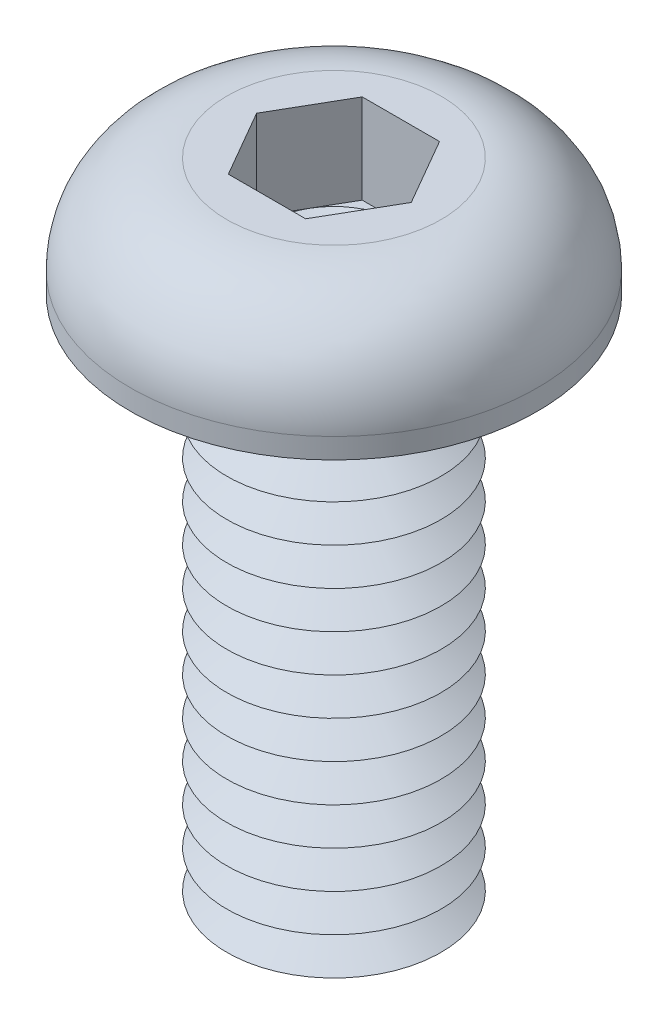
ISO-10303-21;
HEADER;
FILE_DESCRIPTION(('STEP AP214'),'2;1');
FILE_NAME('part.step','',(''),(''),'','','');
FILE_SCHEMA(('AUTOMOTIVE_DESIGN { 1 0 10303 214 1 1 1 1 }'));
ENDSEC;
DATA;
#1=APPLICATION_CONTEXT('core data for automotive mechanical design processes');
#2=APPLICATION_PROTOCOL_DEFINITION('international standard','automotive_design',2000,#1);
#3=PRODUCT_CONTEXT('',#1,'mechanical');
#4=PRODUCT('Part','Part','',(#3));
#5=PRODUCT_RELATED_PRODUCT_CATEGORY('part','',(#4));
#6=PRODUCT_DEFINITION_FORMATION('','',#4);
#7=PRODUCT_DEFINITION_CONTEXT('part definition',#1,'design');
#8=PRODUCT_DEFINITION('design','',#6,#7);
#9=PRODUCT_DEFINITION_SHAPE('','',#8);
#10=(LENGTH_UNIT() NAMED_UNIT(*) SI_UNIT(.MILLI.,.METRE.));
#11=(NAMED_UNIT(*) PLANE_ANGLE_UNIT() SI_UNIT($,.RADIAN.));
#12=(NAMED_UNIT(*) SI_UNIT($,.STERADIAN.) SOLID_ANGLE_UNIT());
#13=UNCERTAINTY_MEASURE_WITH_UNIT(LENGTH_MEASURE(1.E-05),#10,'distance_accuracy_value','');
#14=(GEOMETRIC_REPRESENTATION_CONTEXT(3) GLOBAL_UNCERTAINTY_ASSIGNED_CONTEXT((#13)) GLOBAL_UNIT_ASSIGNED_CONTEXT((#10,
#11,#12)) REPRESENTATION_CONTEXT('',''));
#15=CARTESIAN_POINT('',(0.,0.,0.));
#16=DIRECTION('',(0.,0.,1.));
#17=DIRECTION('',(1.,0.,0.));
#18=AXIS2_PLACEMENT_3D('',#15,#16,#17);
#19=CARTESIAN_POINT('',(0.,0.,0.));
#20=DIRECTION('',(0.,-1.,0.));
#21=DIRECTION('',(0.,0.,-1.));
#22=AXIS2_PLACEMENT_3D('',#19,#20,#21);
#23=TOROIDAL_SURFACE('',#22,2.35,0.35);
#24=CARTESIAN_POINT('',(0.,0.,-2.7));
#25=VERTEX_POINT('',#24);
#26=VERTEX_LOOP('',#25);
#27=FACE_BOUND('',#26,.T.);
#28=ADVANCED_FACE('P0_F12',(#27),#23,.T.);
#29=CLOSED_SHELL('',(#28));
#30=MANIFOLD_SOLID_BREP('P0_B1',#29);
#31=CARTESIAN_POINT('',(0.721687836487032,0.530000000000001,-1.25));
#32=DIRECTION('',(0.,1.,0.));
#33=DIRECTION('',(0.,0.,1.));
#34=AXIS2_PLACEMENT_3D('',#31,#32,#33);
#35=PLANE('',#34);
#36=CARTESIAN_POINT('',(0.,0.530000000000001,0.));
#37=DIRECTION('',(0.,1.,0.));
#38=DIRECTION('',(0.,0.,1.));
#39=AXIS2_PLACEMENT_3D('',#36,#37,#38);
#40=CIRCLE('',#39,1.25);
#41=CARTESIAN_POINT('',(0.,0.530000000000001,1.25));
#42=VERTEX_POINT('',#41);
#43=CARTESIAN_POINT('',(1.08253175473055,0.530000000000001,0.625));
#44=VERTEX_POINT('',#43);
#45=EDGE_CURVE('P1_E93',#42,#44,#40,.T.);
#46=ORIENTED_EDGE('',*,*,#45,.F.);
#47=DIRECTION('',(1.,0.,0.));
#48=VECTOR('',#47,1.);
#49=CARTESIAN_POINT('',(-0.721687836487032,0.530000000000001,1.25));
#50=LINE('',#49,#48);
#51=CARTESIAN_POINT('',(0.721687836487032,0.530000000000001,1.25));
#52=VERTEX_POINT('',#51);
#53=EDGE_CURVE('P1_E116',#42,#52,#50,.T.);
#54=ORIENTED_EDGE('',*,*,#53,.T.);
#55=DIRECTION('',(0.5,0.,-0.866025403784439));
#56=VECTOR('',#55,1.);
#57=CARTESIAN_POINT('',(0.721687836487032,0.530000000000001,1.25));
#58=LINE('',#57,#56);
#59=EDGE_CURVE('P1_E112',#52,#44,#58,.T.);
#60=ORIENTED_EDGE('',*,*,#59,.T.);
#61=EDGE_LOOP('',(#46,#54,#60));
#62=FACE_BOUND('',#61,.T.);
#63=ADVANCED_FACE('P1_F15',(#62),#35,.T.);
#64=CARTESIAN_POINT('',(0.,0.530000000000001,0.));
#65=DIRECTION('',(0.,1.,0.));
#66=DIRECTION('',(0.,0.,1.));
#67=AXIS2_PLACEMENT_3D('',#64,#65,#66);
#68=CIRCLE('',#67,1.25);
#69=CARTESIAN_POINT('',(1.08253175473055,0.530000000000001,-0.625));
#70=VERTEX_POINT('',#69);
#71=EDGE_CURVE('P1_E10',#44,#70,#68,.T.);
#72=ORIENTED_EDGE('',*,*,#71,.F.);
#73=CARTESIAN_POINT('',(1.44337567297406,0.530000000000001,0.));
#74=VERTEX_POINT('',#73);
#75=EDGE_CURVE('P1_E104',#44,#74,#58,.T.);
#76=ORIENTED_EDGE('',*,*,#75,.T.);
#77=DIRECTION('',(-0.5,0.,-0.866025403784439));
#78=VECTOR('',#77,1.);
#79=CARTESIAN_POINT('',(1.44337567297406,0.530000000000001,0.));
#80=LINE('',#79,#78);
#81=EDGE_CURVE('P1_E107',#74,#70,#80,.T.);
#82=ORIENTED_EDGE('',*,*,#81,.T.);
#83=EDGE_LOOP('',(#72,#76,#82));
#84=FACE_BOUND('',#83,.T.);
#85=ADVANCED_FACE('P1_F103',(#84),#35,.T.);
#86=CARTESIAN_POINT('',(0.,0.530000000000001,-1.25));
#87=VERTEX_POINT('',#86);
#88=EDGE_CURVE('P1_E24',#70,#87,#68,.T.);
#89=ORIENTED_EDGE('',*,*,#88,.F.);
#90=CARTESIAN_POINT('',(0.721687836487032,0.530000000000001,-1.25));
#91=VERTEX_POINT('',#90);
#92=EDGE_CURVE('P1_E139',#70,#91,#80,.T.);
#93=ORIENTED_EDGE('',*,*,#92,.T.);
#94=DIRECTION('',(-1.,0.,0.));
#95=VECTOR('',#94,1.);
#96=CARTESIAN_POINT('',(0.721687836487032,0.530000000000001,-1.25));
#97=LINE('',#96,#95);
#98=EDGE_CURVE('P1_E300',#91,#87,#97,.T.);
#99=ORIENTED_EDGE('',*,*,#98,.T.);
#100=EDGE_LOOP('',(#89,#93,#99));
#101=FACE_BOUND('',#100,.T.);
#102=ADVANCED_FACE('P1_F265',(#101),#35,.T.);
#103=CARTESIAN_POINT('',(-1.08253175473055,0.530000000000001,-0.625));
#104=VERTEX_POINT('',#103);
#105=EDGE_CURVE('P1_E295',#87,#104,#68,.T.);
#106=ORIENTED_EDGE('',*,*,#105,.F.);
#107=CARTESIAN_POINT('',(-0.721687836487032,0.530000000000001,-1.25));
#108=VERTEX_POINT('',#107);
#109=EDGE_CURVE('P1_E304',#87,#108,#97,.T.);
#110=ORIENTED_EDGE('',*,*,#109,.T.);
#111=DIRECTION('',(-0.5,0.,0.866025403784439));
#112=VECTOR('',#111,1.);
#113=CARTESIAN_POINT('',(-0.721687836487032,0.530000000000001,-1.25));
#114=LINE('',#113,#112);
#115=EDGE_CURVE('P1_E299',#108,#104,#114,.T.);
#116=ORIENTED_EDGE('',*,*,#115,.T.);
#117=EDGE_LOOP('',(#106,#110,#116));
#118=FACE_BOUND('',#117,.T.);
#119=ADVANCED_FACE('P1_F279',(#118),#35,.T.);
#120=CARTESIAN_POINT('',(-1.08253175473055,0.530000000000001,0.625));
#121=VERTEX_POINT('',#120);
#122=EDGE_CURVE('P1_E31',#104,#121,#68,.T.);
#123=ORIENTED_EDGE('',*,*,#122,.F.);
#124=CARTESIAN_POINT('',(-1.44337567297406,0.530000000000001,0.));
#125=VERTEX_POINT('',#124);
#126=EDGE_CURVE('P1_E291',#104,#125,#114,.T.);
#127=ORIENTED_EDGE('',*,*,#126,.T.);
#128=DIRECTION('',(0.5,0.,0.866025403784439));
#129=VECTOR('',#128,1.);
#130=CARTESIAN_POINT('',(-1.44337567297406,0.530000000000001,0.));
#131=LINE('',#130,#129);
#132=EDGE_CURVE('P1_E294',#125,#121,#131,.T.);
#133=ORIENTED_EDGE('',*,*,#132,.T.);
#134=EDGE_LOOP('',(#123,#127,#133));
#135=FACE_BOUND('',#134,.T.);
#136=ADVANCED_FACE('P1_F270',(#135),#35,.T.);
#137=CARTESIAN_POINT('',(0.,-9.3,0.));
#138=DIRECTION('',(0.,1.,0.));
#139=DIRECTION('',(0.,0.,1.));
#140=AXIS2_PLACEMENT_3D('',#137,#138,#139);
#141=CONICAL_SURFACE('',#140,1.39378221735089,1.0471975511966);
#142=CARTESIAN_POINT('',(0.,-8.95,0.));
#143=DIRECTION('',(0.,-1.,0.));
#144=DIRECTION('',(0.,0.,-1.));
#145=AXIS2_PLACEMENT_3D('',#142,#143,#144);
#146=CIRCLE('',#145,2.);
#147=CARTESIAN_POINT('',(0.,-8.95,-2.));
#148=VERTEX_POINT('',#147);
#149=EDGE_CURVE('P1_E227',#148,#148,#146,.T.);
#150=ORIENTED_EDGE('',*,*,#149,.T.);
#151=EDGE_LOOP('',(#150));
#152=FACE_BOUND('',#151,.T.);
#153=CARTESIAN_POINT('',(0.,-9.3,0.));
#154=DIRECTION('',(0.,-1.,0.));
#155=DIRECTION('',(0.,0.,-1.));
#156=AXIS2_PLACEMENT_3D('',#153,#154,#155);
#157=CIRCLE('',#156,1.39378221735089);
#158=CARTESIAN_POINT('',(0.,-9.3,-1.39378221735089));
#159=VERTEX_POINT('',#158);
#160=EDGE_CURVE('P1_E230',#159,#159,#157,.T.);
#161=ORIENTED_EDGE('',*,*,#160,.F.);
#162=EDGE_LOOP('',(#161));
#163=FACE_BOUND('',#162,.T.);
#164=ADVANCED_FACE('P1_F278',(#152,#163),#141,.T.);
#165=CARTESIAN_POINT('',(0.,-9.65,0.));
#166=DIRECTION('',(0.,-1.,0.));
#167=DIRECTION('',(0.,0.,-1.));
#168=AXIS2_PLACEMENT_3D('',#165,#166,#167);
#169=CONICAL_SURFACE('',#168,2.,1.0471975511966);
#170=ORIENTED_EDGE('',*,*,#160,.T.);
#171=EDGE_LOOP('',(#170));
#172=FACE_BOUND('',#171,.T.);
#173=CARTESIAN_POINT('',(0.,-9.65,0.));
#174=DIRECTION('',(0.,-1.,0.));
#175=DIRECTION('',(0.,0.,-1.));
#176=AXIS2_PLACEMENT_3D('',#173,#174,#175);
#177=CIRCLE('',#176,2.);
#178=CARTESIAN_POINT('',(0.,-9.65,-2.));
#179=VERTEX_POINT('',#178);
#180=EDGE_CURVE('P1_E233',#179,#179,#177,.T.);
#181=ORIENTED_EDGE('',*,*,#180,.F.);
#182=EDGE_LOOP('',(#181));
#183=FACE_BOUND('',#182,.T.);
#184=ADVANCED_FACE('P1_F285',(#172,#183),#169,.T.);
#185=CARTESIAN_POINT('',(0.,-10.,0.));
#186=DIRECTION('',(0.,1.,0.));
#187=DIRECTION('',(0.,0.,1.));
#188=AXIS2_PLACEMENT_3D('',#185,#186,#187);
#189=PLANE('',#188);
#190=CARTESIAN_POINT('',(0.,-10.,0.));
#191=DIRECTION('',(0.,-1.,0.));
#192=DIRECTION('',(0.,0.,-1.));
#193=AXIS2_PLACEMENT_3D('',#190,#191,#192);
#194=CIRCLE('',#193,1.39378221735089);
#195=CARTESIAN_POINT('',(0.,-10.,-1.39378221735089));
#196=VERTEX_POINT('',#195);
#197=EDGE_CURVE('P1_E236',#196,#196,#194,.T.);
#198=ORIENTED_EDGE('',*,*,#197,.T.);
#199=EDGE_LOOP('',(#198));
#200=FACE_BOUND('',#199,.T.);
#201=ADVANCED_FACE('P1_F363',(#200),#189,.F.);
#202=CARTESIAN_POINT('',(0.,-10.,0.));
#203=DIRECTION('',(0.,1.,0.));
#204=DIRECTION('',(0.,0.,1.));
#205=AXIS2_PLACEMENT_3D('',#202,#203,#204);
#206=CONICAL_SURFACE('',#205,1.39378221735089,1.0471975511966);
#207=ORIENTED_EDGE('',*,*,#180,.T.);
#208=EDGE_LOOP('',(#207));
#209=FACE_BOUND('',#208,.T.);
#210=ORIENTED_EDGE('',*,*,#197,.F.);
#211=EDGE_LOOP('',(#210));
#212=FACE_BOUND('',#211,.T.);
#213=ADVANCED_FACE('P1_F374',(#209,#212),#206,.T.);
#214=CARTESIAN_POINT('',(0.,-8.6,0.));
#215=DIRECTION('',(0.,1.,0.));
#216=DIRECTION('',(0.,0.,1.));
#217=AXIS2_PLACEMENT_3D('',#214,#215,#216);
#218=CONICAL_SURFACE('',#217,1.39378221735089,1.0471975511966);
#219=CARTESIAN_POINT('',(0.,-8.25,0.));
#220=DIRECTION('',(0.,-1.,0.));
#221=DIRECTION('',(0.,0.,-1.));
#222=AXIS2_PLACEMENT_3D('',#219,#220,#221);
#223=CIRCLE('',#222,2.);
#224=CARTESIAN_POINT('',(0.,-8.25,-2.));
#225=VERTEX_POINT('',#224);
#226=EDGE_CURVE('P1_E221',#225,#225,#223,.T.);
#227=ORIENTED_EDGE('',*,*,#226,.T.);
#228=EDGE_LOOP('',(#227));
#229=FACE_BOUND('',#228,.T.);
#230=CARTESIAN_POINT('',(0.,-8.6,0.));
#231=DIRECTION('',(0.,-1.,0.));
#232=DIRECTION('',(0.,0.,-1.));
#233=AXIS2_PLACEMENT_3D('',#230,#231,#232);
#234=CIRCLE('',#233,1.39378221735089);
#235=CARTESIAN_POINT('',(0.,-8.6,-1.39378221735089));
#236=VERTEX_POINT('',#235);
#237=EDGE_CURVE('P1_E224',#236,#236,#234,.T.);
#238=ORIENTED_EDGE('',*,*,#237,.F.);
#239=EDGE_LOOP('',(#238));
#240=FACE_BOUND('',#239,.T.);
#241=ADVANCED_FACE('P1_F383',(#229,#240),#218,.T.);
#242=CARTESIAN_POINT('',(0.,-8.95,0.));
#243=DIRECTION('',(0.,-1.,0.));
#244=DIRECTION('',(0.,0.,-1.));
#245=AXIS2_PLACEMENT_3D('',#242,#243,#244);
#246=CONICAL_SURFACE('',#245,2.,1.0471975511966);
#247=ORIENTED_EDGE('',*,*,#237,.T.);
#248=EDGE_LOOP('',(#247));
#249=FACE_BOUND('',#248,.T.);
#250=ORIENTED_EDGE('',*,*,#149,.F.);
#251=EDGE_LOOP('',(#250));
#252=FACE_BOUND('',#251,.T.);
#253=ADVANCED_FACE('P1_F392',(#249,#252),#246,.T.);
#254=CARTESIAN_POINT('',(0.,-7.9,0.));
#255=DIRECTION('',(0.,1.,0.));
#256=DIRECTION('',(0.,0.,1.));
#257=AXIS2_PLACEMENT_3D('',#254,#255,#256);
#258=CONICAL_SURFACE('',#257,1.39378221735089,1.0471975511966);
#259=CARTESIAN_POINT('',(0.,-7.55,0.));
#260=DIRECTION('',(0.,-1.,0.));
#261=DIRECTION('',(0.,0.,-1.));
#262=AXIS2_PLACEMENT_3D('',#259,#260,#261);
#263=CIRCLE('',#262,2.);
#264=CARTESIAN_POINT('',(0.,-7.55,-2.));
#265=VERTEX_POINT('',#264);
#266=EDGE_CURVE('P1_E215',#265,#265,#263,.T.);
#267=ORIENTED_EDGE('',*,*,#266,.T.);
#268=EDGE_LOOP('',(#267));
#269=FACE_BOUND('',#268,.T.);
#270=CARTESIAN_POINT('',(0.,-7.9,0.));
#271=DIRECTION('',(0.,-1.,0.));
#272=DIRECTION('',(0.,0.,-1.));
#273=AXIS2_PLACEMENT_3D('',#270,#271,#272);
#274=CIRCLE('',#273,1.39378221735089);
#275=CARTESIAN_POINT('',(0.,-7.9,-1.39378221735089));
#276=VERTEX_POINT('',#275);
#277=EDGE_CURVE('P1_E218',#276,#276,#274,.T.);
#278=ORIENTED_EDGE('',*,*,#277,.F.);
#279=EDGE_LOOP('',(#278));
#280=FACE_BOUND('',#279,.T.);
#281=ADVANCED_FACE('P1_F402',(#269,#280),#258,.T.);
#282=CARTESIAN_POINT('',(0.,-8.25,0.));
#283=DIRECTION('',(0.,-1.,0.));
#284=DIRECTION('',(0.,0.,-1.));
#285=AXIS2_PLACEMENT_3D('',#282,#283,#284);
#286=CONICAL_SURFACE('',#285,2.,1.0471975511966);
#287=ORIENTED_EDGE('',*,*,#277,.T.);
#288=EDGE_LOOP('',(#287));
#289=FACE_BOUND('',#288,.T.);
#290=ORIENTED_EDGE('',*,*,#226,.F.);
#291=EDGE_LOOP('',(#290));
#292=FACE_BOUND('',#291,.T.);
#293=ADVANCED_FACE('P1_F412',(#289,#292),#286,.T.);
#294=CARTESIAN_POINT('',(0.,-7.2,0.));
#295=DIRECTION('',(0.,1.,0.));
#296=DIRECTION('',(0.,0.,1.));
#297=AXIS2_PLACEMENT_3D('',#294,#295,#296);
#298=CONICAL_SURFACE('',#297,1.39378221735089,1.0471975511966);
#299=CARTESIAN_POINT('',(0.,-6.85,0.));
#300=DIRECTION('',(0.,-1.,0.));
#301=DIRECTION('',(0.,0.,-1.));
#302=AXIS2_PLACEMENT_3D('',#299,#300,#301);
#303=CIRCLE('',#302,2.);
#304=CARTESIAN_POINT('',(0.,-6.85,-2.));
#305=VERTEX_POINT('',#304);
#306=EDGE_CURVE('P1_E209',#305,#305,#303,.T.);
#307=ORIENTED_EDGE('',*,*,#306,.T.);
#308=EDGE_LOOP('',(#307));
#309=FACE_BOUND('',#308,.T.);
#310=CARTESIAN_POINT('',(0.,-7.2,0.));
#311=DIRECTION('',(0.,-1.,0.));
#312=DIRECTION('',(0.,0.,-1.));
#313=AXIS2_PLACEMENT_3D('',#310,#311,#312);
#314=CIRCLE('',#313,1.39378221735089);
#315=CARTESIAN_POINT('',(0.,-7.2,-1.39378221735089));
#316=VERTEX_POINT('',#315);
#317=EDGE_CURVE('P1_E212',#316,#316,#314,.T.);
#318=ORIENTED_EDGE('',*,*,#317,.F.);
#319=EDGE_LOOP('',(#318));
#320=FACE_BOUND('',#319,.T.);
#321=ADVANCED_FACE('P1_F422',(#309,#320),#298,.T.);
#322=CARTESIAN_POINT('',(0.,-7.55,0.));
#323=DIRECTION('',(0.,-1.,0.));
#324=DIRECTION('',(0.,0.,-1.));
#325=AXIS2_PLACEMENT_3D('',#322,#323,#324);
#326=CONICAL_SURFACE('',#325,2.,1.0471975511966);
#327=ORIENTED_EDGE('',*,*,#317,.T.);
#328=EDGE_LOOP('',(#327));
#329=FACE_BOUND('',#328,.T.);
#330=ORIENTED_EDGE('',*,*,#266,.F.);
#331=EDGE_LOOP('',(#330));
#332=FACE_BOUND('',#331,.T.);
#333=ADVANCED_FACE('P1_F432',(#329,#332),#326,.T.);
#334=CARTESIAN_POINT('',(0.,-6.5,0.));
#335=DIRECTION('',(0.,1.,0.));
#336=DIRECTION('',(0.,0.,1.));
#337=AXIS2_PLACEMENT_3D('',#334,#335,#336);
#338=CONICAL_SURFACE('',#337,1.39378221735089,1.0471975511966);
#339=CARTESIAN_POINT('',(0.,-6.15,0.));
#340=DIRECTION('',(0.,-1.,0.));
#341=DIRECTION('',(0.,0.,-1.));
#342=AXIS2_PLACEMENT_3D('',#339,#340,#341);
#343=CIRCLE('',#342,2.);
#344=CARTESIAN_POINT('',(0.,-6.15,-2.));
#345=VERTEX_POINT('',#344);
#346=EDGE_CURVE('P1_E203',#345,#345,#343,.T.);
#347=ORIENTED_EDGE('',*,*,#346,.T.);
#348=EDGE_LOOP('',(#347));
#349=FACE_BOUND('',#348,.T.);
#350=CARTESIAN_POINT('',(0.,-6.5,0.));
#351=DIRECTION('',(0.,-1.,0.));
#352=DIRECTION('',(0.,0.,-1.));
#353=AXIS2_PLACEMENT_3D('',#350,#351,#352);
#354=CIRCLE('',#353,1.39378221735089);
#355=CARTESIAN_POINT('',(0.,-6.5,-1.39378221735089));
#356=VERTEX_POINT('',#355);
#357=EDGE_CURVE('P1_E206',#356,#356,#354,.T.);
#358=ORIENTED_EDGE('',*,*,#357,.F.);
#359=EDGE_LOOP('',(#358));
#360=FACE_BOUND('',#359,.T.);
#361=ADVANCED_FACE('P1_F442',(#349,#360),#338,.T.);
#362=CARTESIAN_POINT('',(0.,-6.85,0.));
#363=DIRECTION('',(0.,-1.,0.));
#364=DIRECTION('',(0.,0.,-1.));
#365=AXIS2_PLACEMENT_3D('',#362,#363,#364);
#366=CONICAL_SURFACE('',#365,2.,1.0471975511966);
#367=ORIENTED_EDGE('',*,*,#357,.T.);
#368=EDGE_LOOP('',(#367));
#369=FACE_BOUND('',#368,.T.);
#370=ORIENTED_EDGE('',*,*,#306,.F.);
#371=EDGE_LOOP('',(#370));
#372=FACE_BOUND('',#371,.T.);
#373=ADVANCED_FACE('P1_F452',(#369,#372),#366,.T.);
#374=CARTESIAN_POINT('',(0.,-5.8,0.));
#375=DIRECTION('',(0.,1.,0.));
#376=DIRECTION('',(0.,0.,1.));
#377=AXIS2_PLACEMENT_3D('',#374,#375,#376);
#378=CONICAL_SURFACE('',#377,1.39378221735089,1.0471975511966);
#379=CARTESIAN_POINT('',(0.,-5.45,0.));
#380=DIRECTION('',(0.,-1.,0.));
#381=DIRECTION('',(0.,0.,-1.));
#382=AXIS2_PLACEMENT_3D('',#379,#380,#381);
#383=CIRCLE('',#382,2.);
#384=CARTESIAN_POINT('',(0.,-5.45,-2.));
#385=VERTEX_POINT('',#384);
#386=EDGE_CURVE('P1_E197',#385,#385,#383,.T.);
#387=ORIENTED_EDGE('',*,*,#386,.T.);
#388=EDGE_LOOP('',(#387));
#389=FACE_BOUND('',#388,.T.);
#390=CARTESIAN_POINT('',(0.,-5.8,0.));
#391=DIRECTION('',(0.,-1.,0.));
#392=DIRECTION('',(0.,0.,-1.));
#393=AXIS2_PLACEMENT_3D('',#390,#391,#392);
#394=CIRCLE('',#393,1.39378221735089);
#395=CARTESIAN_POINT('',(0.,-5.8,-1.39378221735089));
#396=VERTEX_POINT('',#395);
#397=EDGE_CURVE('P1_E200',#396,#396,#394,.T.);
#398=ORIENTED_EDGE('',*,*,#397,.F.);
#399=EDGE_LOOP('',(#398));
#400=FACE_BOUND('',#399,.T.);
#401=ADVANCED_FACE('P1_F462',(#389,#400),#378,.T.);
#402=CARTESIAN_POINT('',(0.,-6.15,0.));
#403=DIRECTION('',(0.,-1.,0.));
#404=DIRECTION('',(0.,0.,-1.));
#405=AXIS2_PLACEMENT_3D('',#402,#403,#404);
#406=CONICAL_SURFACE('',#405,2.,1.0471975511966);
#407=ORIENTED_EDGE('',*,*,#397,.T.);
#408=EDGE_LOOP('',(#407));
#409=FACE_BOUND('',#408,.T.);
#410=ORIENTED_EDGE('',*,*,#346,.F.);
#411=EDGE_LOOP('',(#410));
#412=FACE_BOUND('',#411,.T.);
#413=ADVANCED_FACE('P1_F472',(#409,#412),#406,.T.);
#414=CARTESIAN_POINT('',(0.,-5.1,0.));
#415=DIRECTION('',(0.,1.,0.));
#416=DIRECTION('',(0.,0.,1.));
#417=AXIS2_PLACEMENT_3D('',#414,#415,#416);
#418=CONICAL_SURFACE('',#417,1.39378221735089,1.0471975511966);
#419=CARTESIAN_POINT('',(0.,-4.75,0.));
#420=DIRECTION('',(0.,-1.,0.));
#421=DIRECTION('',(0.,0.,-1.));
#422=AXIS2_PLACEMENT_3D('',#419,#420,#421);
#423=CIRCLE('',#422,2.);
#424=CARTESIAN_POINT('',(0.,-4.75,-2.));
#425=VERTEX_POINT('',#424);
#426=EDGE_CURVE('P1_E191',#425,#425,#423,.T.);
#427=ORIENTED_EDGE('',*,*,#426,.T.);
#428=EDGE_LOOP('',(#427));
#429=FACE_BOUND('',#428,.T.);
#430=CARTESIAN_POINT('',(0.,-5.1,0.));
#431=DIRECTION('',(0.,-1.,0.));
#432=DIRECTION('',(0.,0.,-1.));
#433=AXIS2_PLACEMENT_3D('',#430,#431,#432);
#434=CIRCLE('',#433,1.39378221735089);
#435=CARTESIAN_POINT('',(0.,-5.1,-1.39378221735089));
#436=VERTEX_POINT('',#435);
#437=EDGE_CURVE('P1_E194',#436,#436,#434,.T.);
#438=ORIENTED_EDGE('',*,*,#437,.F.);
#439=EDGE_LOOP('',(#438));
#440=FACE_BOUND('',#439,.T.);
#441=ADVANCED_FACE('P1_F482',(#429,#440),#418,.T.);
#442=CARTESIAN_POINT('',(0.,-5.45,0.));
#443=DIRECTION('',(0.,-1.,0.));
#444=DIRECTION('',(0.,0.,-1.));
#445=AXIS2_PLACEMENT_3D('',#442,#443,#444);
#446=CONICAL_SURFACE('',#445,2.,1.0471975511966);
#447=ORIENTED_EDGE('',*,*,#437,.T.);
#448=EDGE_LOOP('',(#447));
#449=FACE_BOUND('',#448,.T.);
#450=ORIENTED_EDGE('',*,*,#386,.F.);
#451=EDGE_LOOP('',(#450));
#452=FACE_BOUND('',#451,.T.);
#453=ADVANCED_FACE('P1_F492',(#449,#452),#446,.T.);
#454=CARTESIAN_POINT('',(0.,-4.4,0.));
#455=DIRECTION('',(0.,1.,0.));
#456=DIRECTION('',(0.,0.,1.));
#457=AXIS2_PLACEMENT_3D('',#454,#455,#456);
#458=CONICAL_SURFACE('',#457,1.39378221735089,1.0471975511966);
#459=CARTESIAN_POINT('',(0.,-4.05,0.));
#460=DIRECTION('',(0.,-1.,0.));
#461=DIRECTION('',(0.,0.,-1.));
#462=AXIS2_PLACEMENT_3D('',#459,#460,#461);
#463=CIRCLE('',#462,2.);
#464=CARTESIAN_POINT('',(0.,-4.05,-2.));
#465=VERTEX_POINT('',#464);
#466=EDGE_CURVE('P1_E185',#465,#465,#463,.T.);
#467=ORIENTED_EDGE('',*,*,#466,.T.);
#468=EDGE_LOOP('',(#467));
#469=FACE_BOUND('',#468,.T.);
#470=CARTESIAN_POINT('',(0.,-4.4,0.));
#471=DIRECTION('',(0.,-1.,0.));
#472=DIRECTION('',(0.,0.,-1.));
#473=AXIS2_PLACEMENT_3D('',#470,#471,#472);
#474=CIRCLE('',#473,1.39378221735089);
#475=CARTESIAN_POINT('',(0.,-4.4,-1.39378221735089));
#476=VERTEX_POINT('',#475);
#477=EDGE_CURVE('P1_E188',#476,#476,#474,.T.);
#478=ORIENTED_EDGE('',*,*,#477,.F.);
#479=EDGE_LOOP('',(#478));
#480=FACE_BOUND('',#479,.T.);
#481=ADVANCED_FACE('P1_F502',(#469,#480),#458,.T.);
#482=CARTESIAN_POINT('',(0.,-4.75,0.));
#483=DIRECTION('',(0.,-1.,0.));
#484=DIRECTION('',(0.,0.,-1.));
#485=AXIS2_PLACEMENT_3D('',#482,#483,#484);
#486=CONICAL_SURFACE('',#485,2.,1.0471975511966);
#487=ORIENTED_EDGE('',*,*,#477,.T.);
#488=EDGE_LOOP('',(#487));
#489=FACE_BOUND('',#488,.T.);
#490=ORIENTED_EDGE('',*,*,#426,.F.);
#491=EDGE_LOOP('',(#490));
#492=FACE_BOUND('',#491,.T.);
#493=ADVANCED_FACE('P1_F512',(#489,#492),#486,.T.);
#494=CARTESIAN_POINT('',(0.,-3.7,0.));
#495=DIRECTION('',(0.,1.,0.));
#496=DIRECTION('',(0.,0.,1.));
#497=AXIS2_PLACEMENT_3D('',#494,#495,#496);
#498=CONICAL_SURFACE('',#497,1.39378221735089,1.0471975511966);
#499=CARTESIAN_POINT('',(0.,-3.35,0.));
#500=DIRECTION('',(0.,-1.,0.));
#501=DIRECTION('',(0.,0.,-1.));
#502=AXIS2_PLACEMENT_3D('',#499,#500,#501);
#503=CIRCLE('',#502,2.);
#504=CARTESIAN_POINT('',(0.,-3.35,-2.));
#505=VERTEX_POINT('',#504);
#506=EDGE_CURVE('P1_E179',#505,#505,#503,.T.);
#507=ORIENTED_EDGE('',*,*,#506,.T.);
#508=EDGE_LOOP('',(#507));
#509=FACE_BOUND('',#508,.T.);
#510=CARTESIAN_POINT('',(0.,-3.7,0.));
#511=DIRECTION('',(0.,-1.,0.));
#512=DIRECTION('',(0.,0.,-1.));
#513=AXIS2_PLACEMENT_3D('',#510,#511,#512);
#514=CIRCLE('',#513,1.39378221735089);
#515=CARTESIAN_POINT('',(0.,-3.7,-1.39378221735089));
#516=VERTEX_POINT('',#515);
#517=EDGE_CURVE('P1_E182',#516,#516,#514,.T.);
#518=ORIENTED_EDGE('',*,*,#517,.F.);
#519=EDGE_LOOP('',(#518));
#520=FACE_BOUND('',#519,.T.);
#521=ADVANCED_FACE('P1_F522',(#509,#520),#498,.T.);
#522=CARTESIAN_POINT('',(0.,-4.05,0.));
#523=DIRECTION('',(0.,-1.,0.));
#524=DIRECTION('',(0.,0.,-1.));
#525=AXIS2_PLACEMENT_3D('',#522,#523,#524);
#526=CONICAL_SURFACE('',#525,2.,1.0471975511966);
#527=ORIENTED_EDGE('',*,*,#517,.T.);
#528=EDGE_LOOP('',(#527));
#529=FACE_BOUND('',#528,.T.);
#530=ORIENTED_EDGE('',*,*,#466,.F.);
#531=EDGE_LOOP('',(#530));
#532=FACE_BOUND('',#531,.T.);
#533=ADVANCED_FACE('P1_F532',(#529,#532),#526,.T.);
#534=CARTESIAN_POINT('',(0.,-3.,0.));
#535=DIRECTION('',(0.,1.,0.));
#536=DIRECTION('',(0.,0.,1.));
#537=AXIS2_PLACEMENT_3D('',#534,#535,#536);
#538=CONICAL_SURFACE('',#537,1.39378221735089,1.0471975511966);
#539=CARTESIAN_POINT('',(0.,-2.65,0.));
#540=DIRECTION('',(0.,-1.,0.));
#541=DIRECTION('',(0.,0.,-1.));
#542=AXIS2_PLACEMENT_3D('',#539,#540,#541);
#543=CIRCLE('',#542,2.);
#544=CARTESIAN_POINT('',(0.,-2.65,-2.));
#545=VERTEX_POINT('',#544);
#546=EDGE_CURVE('P1_E173',#545,#545,#543,.T.);
#547=ORIENTED_EDGE('',*,*,#546,.T.);
#548=EDGE_LOOP('',(#547));
#549=FACE_BOUND('',#548,.T.);
#550=CARTESIAN_POINT('',(0.,-3.,0.));
#551=DIRECTION('',(0.,-1.,0.));
#552=DIRECTION('',(0.,0.,-1.));
#553=AXIS2_PLACEMENT_3D('',#550,#551,#552);
#554=CIRCLE('',#553,1.39378221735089);
#555=CARTESIAN_POINT('',(0.,-3.,-1.39378221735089));
#556=VERTEX_POINT('',#555);
#557=EDGE_CURVE('P1_E176',#556,#556,#554,.T.);
#558=ORIENTED_EDGE('',*,*,#557,.F.);
#559=EDGE_LOOP('',(#558));
#560=FACE_BOUND('',#559,.T.);
#561=ADVANCED_FACE('P1_F542',(#549,#560),#538,.T.);
#562=CARTESIAN_POINT('',(0.,-3.35,0.));
#563=DIRECTION('',(0.,-1.,0.));
#564=DIRECTION('',(0.,0.,-1.));
#565=AXIS2_PLACEMENT_3D('',#562,#563,#564);
#566=CONICAL_SURFACE('',#565,2.,1.0471975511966);
#567=ORIENTED_EDGE('',*,*,#557,.T.);
#568=EDGE_LOOP('',(#567));
#569=FACE_BOUND('',#568,.T.);
#570=ORIENTED_EDGE('',*,*,#506,.F.);
#571=EDGE_LOOP('',(#570));
#572=FACE_BOUND('',#571,.T.);
#573=ADVANCED_FACE('P1_F552',(#569,#572),#566,.T.);
#574=CARTESIAN_POINT('',(0.,-2.3,0.));
#575=DIRECTION('',(0.,1.,0.));
#576=DIRECTION('',(0.,0.,1.));
#577=AXIS2_PLACEMENT_3D('',#574,#575,#576);
#578=CONICAL_SURFACE('',#577,1.39378221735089,1.0471975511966);
#579=CARTESIAN_POINT('',(0.,-1.95,0.));
#580=DIRECTION('',(0.,-1.,0.));
#581=DIRECTION('',(0.,0.,-1.));
#582=AXIS2_PLACEMENT_3D('',#579,#580,#581);
#583=CIRCLE('',#582,2.);
#584=CARTESIAN_POINT('',(0.,-1.95,-2.));
#585=VERTEX_POINT('',#584);
#586=EDGE_CURVE('P1_E164',#585,#585,#583,.T.);
#587=ORIENTED_EDGE('',*,*,#586,.T.);
#588=EDGE_LOOP('',(#587));
#589=FACE_BOUND('',#588,.T.);
#590=CARTESIAN_POINT('',(0.,-2.3,0.));
#591=DIRECTION('',(0.,-1.,0.));
#592=DIRECTION('',(0.,0.,-1.));
#593=AXIS2_PLACEMENT_3D('',#590,#591,#592);
#594=CIRCLE('',#593,1.39378221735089);
#595=CARTESIAN_POINT('',(0.,-2.3,-1.39378221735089));
#596=VERTEX_POINT('',#595);
#597=EDGE_CURVE('P1_E170',#596,#596,#594,.T.);
#598=ORIENTED_EDGE('',*,*,#597,.F.);
#599=EDGE_LOOP('',(#598));
#600=FACE_BOUND('',#599,.T.);
#601=ADVANCED_FACE('P1_F562',(#589,#600),#578,.T.);
#602=CARTESIAN_POINT('',(0.,-2.65,0.));
#603=DIRECTION('',(0.,-1.,0.));
#604=DIRECTION('',(0.,0.,-1.));
#605=AXIS2_PLACEMENT_3D('',#602,#603,#604);
#606=CONICAL_SURFACE('',#605,2.,1.0471975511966);
#607=ORIENTED_EDGE('',*,*,#597,.T.);
#608=EDGE_LOOP('',(#607));
#609=FACE_BOUND('',#608,.T.);
#610=ORIENTED_EDGE('',*,*,#546,.F.);
#611=EDGE_LOOP('',(#610));
#612=FACE_BOUND('',#611,.T.);
#613=ADVANCED_FACE('P1_F572',(#609,#612),#606,.T.);
#614=CARTESIAN_POINT('',(0.,-1.6,0.));
#615=DIRECTION('',(0.,1.,0.));
#616=DIRECTION('',(0.,0.,1.));
#617=AXIS2_PLACEMENT_3D('',#614,#615,#616);
#618=CONICAL_SURFACE('',#617,1.39378221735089,1.0471975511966);
#619=CARTESIAN_POINT('',(0.,-1.25,0.));
#620=DIRECTION('',(0.,-1.,0.));
#621=DIRECTION('',(0.,0.,-1.));
#622=AXIS2_PLACEMENT_3D('',#619,#620,#621);
#623=CIRCLE('',#622,2.);
#624=CARTESIAN_POINT('',(0.,-1.25,-2.));
#625=VERTEX_POINT('',#624);
#626=EDGE_CURVE('P1_E167',#625,#625,#623,.T.);
#627=ORIENTED_EDGE('',*,*,#626,.T.);
#628=EDGE_LOOP('',(#627));
#629=FACE_BOUND('',#628,.T.);
#630=CARTESIAN_POINT('',(0.,-1.6,0.));
#631=DIRECTION('',(0.,-1.,0.));
#632=DIRECTION('',(0.,0.,-1.));
#633=AXIS2_PLACEMENT_3D('',#630,#631,#632);
#634=CIRCLE('',#633,1.39378221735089);
#635=CARTESIAN_POINT('',(0.,-1.6,-1.39378221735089));
#636=VERTEX_POINT('',#635);
#637=EDGE_CURVE('P1_E161',#636,#636,#634,.T.);
#638=ORIENTED_EDGE('',*,*,#637,.F.);
#639=EDGE_LOOP('',(#638));
#640=FACE_BOUND('',#639,.T.);
#641=ADVANCED_FACE('P1_F582',(#629,#640),#618,.T.);
#642=CARTESIAN_POINT('',(0.,-1.95,0.));
#643=DIRECTION('',(0.,-1.,0.));
#644=DIRECTION('',(0.,0.,-1.));
#645=AXIS2_PLACEMENT_3D('',#642,#643,#644);
#646=CONICAL_SURFACE('',#645,2.,1.0471975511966);
#647=ORIENTED_EDGE('',*,*,#637,.T.);
#648=EDGE_LOOP('',(#647));
#649=FACE_BOUND('',#648,.T.);
#650=ORIENTED_EDGE('',*,*,#586,.F.);
#651=EDGE_LOOP('',(#650));
#652=FACE_BOUND('',#651,.T.);
#653=ADVANCED_FACE('P1_F592',(#649,#652),#646,.T.);
#654=CARTESIAN_POINT('',(0.,-10.,0.));
#655=DIRECTION('',(0.,1.,0.));
#656=DIRECTION('',(0.,0.,1.));
#657=AXIS2_PLACEMENT_3D('',#654,#655,#656);
#658=CYLINDRICAL_SURFACE('',#657,2.);
#659=CARTESIAN_POINT('',(0.,0.,0.));
#660=DIRECTION('',(0.,-1.,0.));
#661=DIRECTION('',(1.,0.,0.));
#662=AXIS2_PLACEMENT_3D('',#659,#660,#661);
#663=CIRCLE('',#662,2.);
#664=CARTESIAN_POINT('',(2.,0.,0.));
#665=VERTEX_POINT('',#664);
#666=EDGE_CURVE('P1_E141',#665,#665,#663,.F.);
#667=ORIENTED_EDGE('',*,*,#666,.F.);
#668=EDGE_LOOP('',(#667));
#669=FACE_BOUND('',#668,.T.);
#670=ORIENTED_EDGE('',*,*,#626,.F.);
#671=EDGE_LOOP('',(#670));
#672=FACE_BOUND('',#671,.T.);
#673=ADVANCED_FACE('P1_F17',(#669,#672),#658,.T.);
#674=CARTESIAN_POINT('',(0.,0.,0.));
#675=DIRECTION('',(0.,-1.,0.));
#676=DIRECTION('',(0.,0.,-1.));
#677=AXIS2_PLACEMENT_3D('',#674,#675,#676);
#678=TOROIDAL_SURFACE('',#677,2.35,0.35);
#679=ORIENTED_EDGE('',*,*,#666,.T.);
#680=EDGE_LOOP('',(#679));
#681=FACE_BOUND('',#680,.T.);
#682=CARTESIAN_POINT('',(0.,0.,0.));
#683=DIRECTION('',(0.,1.,0.));
#684=DIRECTION('',(-1.,0.,0.));
#685=AXIS2_PLACEMENT_3D('',#682,#683,#684);
#686=CIRCLE('',#685,2.7);
#687=CARTESIAN_POINT('',(-2.7,0.,0.));
#688=VERTEX_POINT('',#687);
#689=EDGE_CURVE('P1_E151',#688,#688,#686,.F.);
#690=ORIENTED_EDGE('',*,*,#689,.T.);
#691=EDGE_LOOP('',(#690));
#692=FACE_BOUND('',#691,.T.);
#693=ADVANCED_FACE('P1_F241',(#681,#692),#678,.F.);
#694=CARTESIAN_POINT('',(2.,2.2,0.));
#695=DIRECTION('',(0.,-1.,0.));
#696=DIRECTION('',(1.,0.,0.));
#697=AXIS2_PLACEMENT_3D('',#694,#695,#696);
#698=PLANE('',#697);
#699=DIRECTION('',(-1.,0.,0.));
#700=VECTOR('',#699,1.);
#701=CARTESIAN_POINT('',(0.721687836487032,2.2,-1.25));
#702=LINE('',#701,#700);
#703=CARTESIAN_POINT('',(0.721687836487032,2.2,-1.25));
#704=VERTEX_POINT('',#703);
#705=CARTESIAN_POINT('',(-0.721687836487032,2.2,-1.25));
#706=VERTEX_POINT('',#705);
#707=EDGE_CURVE('P1_E125',#704,#706,#702,.T.);
#708=ORIENTED_EDGE('',*,*,#707,.F.);
#709=DIRECTION('',(-0.5,0.,-0.866025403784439));
#710=VECTOR('',#709,1.);
#711=CARTESIAN_POINT('',(1.44337567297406,2.2,0.));
#712=LINE('',#711,#710);
#713=CARTESIAN_POINT('',(1.44337567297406,2.2,0.));
#714=VERTEX_POINT('',#713);
#715=EDGE_CURVE('P1_E39',#714,#704,#712,.T.);
#716=ORIENTED_EDGE('',*,*,#715,.F.);
#717=DIRECTION('',(0.5,0.,-0.866025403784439));
#718=VECTOR('',#717,1.);
#719=CARTESIAN_POINT('',(0.721687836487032,2.2,1.25));
#720=LINE('',#719,#718);
#721=CARTESIAN_POINT('',(0.721687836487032,2.2,1.25));
#722=VERTEX_POINT('',#721);
#723=EDGE_CURVE('P1_E137',#722,#714,#720,.T.);
#724=ORIENTED_EDGE('',*,*,#723,.F.);
#725=DIRECTION('',(1.,0.,0.));
#726=VECTOR('',#725,1.);
#727=CARTESIAN_POINT('',(-0.721687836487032,2.2,1.25));
#728=LINE('',#727,#726);
#729=CARTESIAN_POINT('',(-0.721687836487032,2.2,1.25));
#730=VERTEX_POINT('',#729);
#731=EDGE_CURVE('P1_E134',#730,#722,#728,.T.);
#732=ORIENTED_EDGE('',*,*,#731,.F.);
#733=DIRECTION('',(0.5,0.,0.866025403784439));
#734=VECTOR('',#733,1.);
#735=CARTESIAN_POINT('',(-1.44337567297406,2.2,0.));
#736=LINE('',#735,#734);
#737=CARTESIAN_POINT('',(-1.44337567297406,2.2,0.));
#738=VERTEX_POINT('',#737);
#739=EDGE_CURVE('P1_E131',#738,#730,#736,.T.);
#740=ORIENTED_EDGE('',*,*,#739,.F.);
#741=DIRECTION('',(-0.5,0.,0.866025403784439));
#742=VECTOR('',#741,1.);
#743=CARTESIAN_POINT('',(-0.721687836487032,2.2,-1.25));
#744=LINE('',#743,#742);
#745=EDGE_CURVE('P1_E128',#706,#738,#744,.T.);
#746=ORIENTED_EDGE('',*,*,#745,.F.);
#747=EDGE_LOOP('',(#708,#716,#724,#732,#740,#746));
#748=FACE_BOUND('',#747,.T.);
#749=CARTESIAN_POINT('',(0.,2.2,0.));
#750=DIRECTION('',(0.,1.,0.));
#751=DIRECTION('',(-1.,0.,0.));
#752=AXIS2_PLACEMENT_3D('',#749,#750,#751);
#753=CIRCLE('',#752,2.);
#754=CARTESIAN_POINT('',(-2.,2.2,0.));
#755=VERTEX_POINT('',#754);
#756=EDGE_CURVE('P1_E152',#755,#755,#753,.T.);
#757=ORIENTED_EDGE('',*,*,#756,.T.);
#758=EDGE_LOOP('',(#757));
#759=FACE_BOUND('',#758,.T.);
#760=ADVANCED_FACE('P1_F319',(#748,#759),#698,.F.);
#761=CARTESIAN_POINT('',(0.,0.38,0.));
#762=DIRECTION('',(0.,1.,0.));
#763=DIRECTION('',(-1.,0.,0.));
#764=AXIS2_PLACEMENT_3D('',#761,#762,#763);
#765=TOROIDAL_SURFACE('',#764,1.97988888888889,1.82011111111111);
#766=ORIENTED_EDGE('',*,*,#756,.F.);
#767=EDGE_LOOP('',(#766));
#768=FACE_BOUND('',#767,.T.);
#769=CARTESIAN_POINT('',(0.,0.38,0.));
#770=DIRECTION('',(0.,1.,0.));
#771=DIRECTION('',(-1.,0.,0.));
#772=AXIS2_PLACEMENT_3D('',#769,#770,#771);
#773=CIRCLE('',#772,3.8);
#774=CARTESIAN_POINT('',(-3.8,0.38,0.));
#775=VERTEX_POINT('',#774);
#776=EDGE_CURVE('P1_E155',#775,#775,#773,.T.);
#777=ORIENTED_EDGE('',*,*,#776,.T.);
#778=EDGE_LOOP('',(#777));
#779=FACE_BOUND('',#778,.T.);
#780=ADVANCED_FACE('P1_F255',(#768,#779),#765,.T.);
#781=CARTESIAN_POINT('',(0.,2.2,0.));
#782=DIRECTION('',(0.,1.,0.));
#783=DIRECTION('',(-1.,0.,0.));
#784=AXIS2_PLACEMENT_3D('',#781,#782,#783);
#785=CYLINDRICAL_SURFACE('',#784,3.8);
#786=ORIENTED_EDGE('',*,*,#776,.F.);
#787=EDGE_LOOP('',(#786));
#788=FACE_BOUND('',#787,.T.);
#789=CARTESIAN_POINT('',(0.,0.,0.));
#790=DIRECTION('',(0.,1.,0.));
#791=DIRECTION('',(-1.,0.,0.));
#792=AXIS2_PLACEMENT_3D('',#789,#790,#791);
#793=CIRCLE('',#792,3.8);
#794=CARTESIAN_POINT('',(-3.8,0.,0.));
#795=VERTEX_POINT('',#794);
#796=EDGE_CURVE('P1_E158',#795,#795,#793,.T.);
#797=ORIENTED_EDGE('',*,*,#796,.T.);
#798=EDGE_LOOP('',(#797));
#799=FACE_BOUND('',#798,.T.);
#800=ADVANCED_FACE('P1_F246',(#788,#799),#785,.T.);
#801=CARTESIAN_POINT('',(0.,0.,0.));
#802=DIRECTION('',(0.,1.,0.));
#803=DIRECTION('',(-1.,0.,0.));
#804=AXIS2_PLACEMENT_3D('',#801,#802,#803);
#805=PLANE('',#804);
#806=ORIENTED_EDGE('',*,*,#796,.F.);
#807=EDGE_LOOP('',(#806));
#808=FACE_BOUND('',#807,.T.);
#809=ORIENTED_EDGE('',*,*,#689,.F.);
#810=EDGE_LOOP('',(#809));
#811=FACE_BOUND('',#810,.T.);
#812=ADVANCED_FACE('P1_F243',(#808,#811),#805,.F.);
#813=CARTESIAN_POINT('',(1.44337567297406,0.530000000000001,0.));
#814=DIRECTION('',(0.866025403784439,0.,-0.5));
#815=DIRECTION('',(-0.5,0.,-0.866025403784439));
#816=AXIS2_PLACEMENT_3D('',#813,#814,#815);
#817=PLANE('',#816);
#818=ORIENTED_EDGE('',*,*,#715,.T.);
#819=DIRECTION('',(0.,1.,0.));
#820=VECTOR('',#819,1.);
#821=CARTESIAN_POINT('',(0.721687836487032,0.530000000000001,-1.25));
#822=LINE('',#821,#820);
#823=EDGE_CURVE('P1_E118',#91,#704,#822,.T.);
#824=ORIENTED_EDGE('',*,*,#823,.F.);
#825=ORIENTED_EDGE('',*,*,#92,.F.);
#826=ORIENTED_EDGE('',*,*,#81,.F.);
#827=DIRECTION('',(0.,1.,0.));
#828=VECTOR('',#827,1.);
#829=CARTESIAN_POINT('',(1.44337567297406,0.530000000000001,0.));
#830=LINE('',#829,#828);
#831=EDGE_CURVE('P1_E113',#74,#714,#830,.T.);
#832=ORIENTED_EDGE('',*,*,#831,.T.);
#833=EDGE_LOOP('',(#818,#824,#825,#826,#832));
#834=FACE_BOUND('',#833,.T.);
#835=ADVANCED_FACE('P1_F245',(#834),#817,.F.);
#836=CARTESIAN_POINT('',(0.721687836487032,0.530000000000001,1.25));
#837=DIRECTION('',(0.866025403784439,0.,0.5));
#838=DIRECTION('',(0.5,0.,-0.866025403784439));
#839=AXIS2_PLACEMENT_3D('',#836,#837,#838);
#840=PLANE('',#839);
#841=ORIENTED_EDGE('',*,*,#723,.T.);
#842=ORIENTED_EDGE('',*,*,#831,.F.);
#843=ORIENTED_EDGE('',*,*,#75,.F.);
#844=ORIENTED_EDGE('',*,*,#59,.F.);
#845=DIRECTION('',(0.,1.,0.));
#846=VECTOR('',#845,1.);
#847=CARTESIAN_POINT('',(0.721687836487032,0.530000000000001,1.25));
#848=LINE('',#847,#846);
#849=EDGE_CURVE('P1_E142',#52,#722,#848,.T.);
#850=ORIENTED_EDGE('',*,*,#849,.T.);
#851=EDGE_LOOP('',(#841,#842,#843,#844,#850));
#852=FACE_BOUND('',#851,.T.);
#853=ADVANCED_FACE('P1_F111',(#852),#840,.F.);
#854=CARTESIAN_POINT('',(-0.721687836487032,0.530000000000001,1.25));
#855=DIRECTION('',(0.,0.,1.));
#856=DIRECTION('',(1.,0.,0.));
#857=AXIS2_PLACEMENT_3D('',#854,#855,#856);
#858=PLANE('',#857);
#859=ORIENTED_EDGE('',*,*,#731,.T.);
#860=ORIENTED_EDGE('',*,*,#849,.F.);
#861=ORIENTED_EDGE('',*,*,#53,.F.);
#862=CARTESIAN_POINT('',(-0.721687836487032,0.530000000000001,1.25));
#863=VERTEX_POINT('',#862);
#864=EDGE_CURVE('P1_E114',#863,#42,#50,.T.);
#865=ORIENTED_EDGE('',*,*,#864,.F.);
#866=DIRECTION('',(0.,1.,0.));
#867=VECTOR('',#866,1.);
#868=CARTESIAN_POINT('',(-0.721687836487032,0.530000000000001,1.25));
#869=LINE('',#868,#867);
#870=EDGE_CURVE('P1_E144',#863,#730,#869,.T.);
#871=ORIENTED_EDGE('',*,*,#870,.T.);
#872=EDGE_LOOP('',(#859,#860,#861,#865,#871));
#873=FACE_BOUND('',#872,.T.);
#874=ADVANCED_FACE('P1_F314',(#873),#858,.F.);
#875=CARTESIAN_POINT('',(-1.44337567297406,0.530000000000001,0.));
#876=DIRECTION('',(-0.866025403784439,0.,0.5));
#877=DIRECTION('',(0.5,0.,0.866025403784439));
#878=AXIS2_PLACEMENT_3D('',#875,#876,#877);
#879=PLANE('',#878);
#880=ORIENTED_EDGE('',*,*,#739,.T.);
#881=ORIENTED_EDGE('',*,*,#870,.F.);
#882=EDGE_CURVE('P1_E306',#121,#863,#131,.T.);
#883=ORIENTED_EDGE('',*,*,#882,.F.);
#884=ORIENTED_EDGE('',*,*,#132,.F.);
#885=DIRECTION('',(0.,1.,0.));
#886=VECTOR('',#885,1.);
#887=CARTESIAN_POINT('',(-1.44337567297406,0.530000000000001,0.));
#888=LINE('',#887,#886);
#889=EDGE_CURVE('P1_E146',#125,#738,#888,.T.);
#890=ORIENTED_EDGE('',*,*,#889,.T.);
#891=EDGE_LOOP('',(#880,#881,#883,#884,#890));
#892=FACE_BOUND('',#891,.T.);
#893=ADVANCED_FACE('P1_F670',(#892),#879,.F.);
#894=CARTESIAN_POINT('',(-0.721687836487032,0.530000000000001,-1.25));
#895=DIRECTION('',(-0.866025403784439,0.,-0.5));
#896=DIRECTION('',(-0.5,0.,0.866025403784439));
#897=AXIS2_PLACEMENT_3D('',#894,#895,#896);
#898=PLANE('',#897);
#899=ORIENTED_EDGE('',*,*,#745,.T.);
#900=ORIENTED_EDGE('',*,*,#889,.F.);
#901=ORIENTED_EDGE('',*,*,#126,.F.);
#902=ORIENTED_EDGE('',*,*,#115,.F.);
#903=DIRECTION('',(0.,1.,0.));
#904=VECTOR('',#903,1.);
#905=CARTESIAN_POINT('',(-0.721687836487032,0.530000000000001,-1.25));
#906=LINE('',#905,#904);
#907=EDGE_CURVE('P1_E119',#108,#706,#906,.T.);
#908=ORIENTED_EDGE('',*,*,#907,.T.);
#909=EDGE_LOOP('',(#899,#900,#901,#902,#908));
#910=FACE_BOUND('',#909,.T.);
#911=ADVANCED_FACE('P1_F274',(#910),#898,.F.);
#912=CARTESIAN_POINT('',(0.721687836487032,0.530000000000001,-1.25));
#913=DIRECTION('',(0.,0.,-1.));
#914=DIRECTION('',(-1.,0.,0.));
#915=AXIS2_PLACEMENT_3D('',#912,#913,#914);
#916=PLANE('',#915);
#917=ORIENTED_EDGE('',*,*,#707,.T.);
#918=ORIENTED_EDGE('',*,*,#907,.F.);
#919=ORIENTED_EDGE('',*,*,#109,.F.);
#920=ORIENTED_EDGE('',*,*,#98,.F.);
#921=ORIENTED_EDGE('',*,*,#823,.T.);
#922=EDGE_LOOP('',(#917,#918,#919,#920,#921));
#923=FACE_BOUND('',#922,.T.);
#924=ADVANCED_FACE('P1_F268',(#923),#916,.F.);
#925=EDGE_CURVE('P1_E19',#121,#42,#68,.T.);
#926=ORIENTED_EDGE('',*,*,#925,.F.);
#927=ORIENTED_EDGE('',*,*,#882,.T.);
#928=ORIENTED_EDGE('',*,*,#864,.T.);
#929=EDGE_LOOP('',(#926,#927,#928));
#930=FACE_BOUND('',#929,.T.);
#931=ADVANCED_FACE('P1_F90',(#930),#35,.T.);
#932=CARTESIAN_POINT('',(0.,0.530000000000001,0.));
#933=DIRECTION('',(0.,1.,0.));
#934=DIRECTION('',(0.,0.,1.));
#935=AXIS2_PLACEMENT_3D('',#932,#933,#934);
#936=CONICAL_SURFACE('',#935,1.25,1.0471975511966);
#937=CARTESIAN_POINT('',(0.,-0.191687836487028,0.));
#938=VERTEX_POINT('',#937);
#939=VERTEX_LOOP('',#938);
#940=FACE_BOUND('',#939,.T.);
#941=ORIENTED_EDGE('',*,*,#45,.T.);
#942=ORIENTED_EDGE('',*,*,#71,.T.);
#943=ORIENTED_EDGE('',*,*,#88,.T.);
#944=ORIENTED_EDGE('',*,*,#105,.T.);
#945=ORIENTED_EDGE('',*,*,#122,.T.);
#946=ORIENTED_EDGE('',*,*,#925,.T.);
#947=EDGE_LOOP('',(#941,#942,#943,#944,#945,#946));
#948=FACE_BOUND('',#947,.T.);
#949=ADVANCED_FACE('P1_F88',(#940,#948),#936,.F.);
#950=CLOSED_SHELL('',(#63,#85,#102,#119,#136,#164,#184,#201,#213,#241,#253,#281,#293,#321,#333,
#361,#373,#401,#413,#441,#453,#481,#493,#521,#533,#561,#573,#601,#613,#641,#653,#673,#693,#760,
#780,#800,#812,#835,#853,#874,#893,#911,#924,#931,#949));
#951=MANIFOLD_SOLID_BREP('P1_B1',#950);
#952=ADVANCED_BREP_SHAPE_REPRESENTATION('',(#18,#30,#951),#14);
#953=SHAPE_DEFINITION_REPRESENTATION(#9,#952);
ENDSEC;
END-ISO-10303-21;
